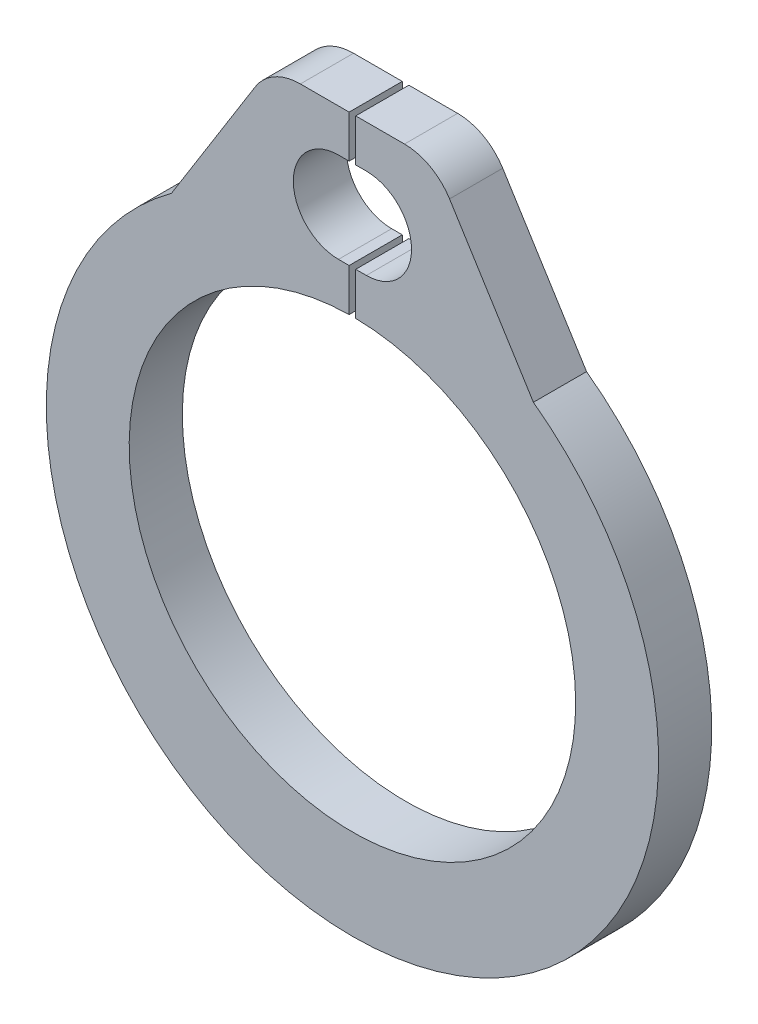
from build123d import *

# Parameters (mm, degrees)
BASE_EXTRUDE_DEPTH = 1


with BuildPart() as part:
    # Sketch1 → Base-Extrude (new body)
    with BuildSketch(Plane.XY):
        with BuildLine():
            Line((-0.263977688, 4.122927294), (-0.263977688, 4.9233838))
            Line((-0.263977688, 4.9233838), (-0.063977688, 4.9233838))
            ThreePointArc((-0.063977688, 4.9233838), (0.786022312, 5.7733838), (-0.063977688, 6.6233838))
            Line((-0.063977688, 6.6233838), (-0.263977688, 6.6233838))
            Line((-0.263977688, 6.6233838), (-0.263977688, 7.422927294))
            Line((-0.263977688, 7.422927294), (0.653440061, 7.422927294))
            ThreePointArc((0.653440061, 7.422927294), (1.138249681, 7.297547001), (1.501488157, 6.952846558))
            Line((1.501488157, 6.952846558), (3.07918301, 4.428007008))
            ThreePointArc((3.07918301, 4.428007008), (-0.325900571, -5.9766162), (-3.730984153, 4.428007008))
            Line((-3.730984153, 4.428007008), (-2.153289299, 6.952846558))
            ThreePointArc((-2.153289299, 6.952846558), (-1.790050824, 7.297547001), (-1.305241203, 7.422927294))
            Line((-1.305241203, 7.422927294), (-0.387823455, 7.422927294))
            Line((-0.387823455, 7.422927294), (-0.387823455, 6.6233838))
            Line((-0.387823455, 6.6233838), (-0.587823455, 6.6233838))
            ThreePointArc((-0.587823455, 6.6233838), (-1.437823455, 5.7733838), (-0.587823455, 4.9233838))
            Line((-0.587823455, 4.9233838), (-0.387823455, 4.9233838))
            Line((-0.387823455, 4.9233838), (-0.387823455, 4.122927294))
            ThreePointArc((-0.387823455, 4.122927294), (-0.325900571, -4.2766162), (-0.263977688, 4.122927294))
        make_face()
    extrude(amount=BASE_EXTRUDE_DEPTH)


solid = part.part
